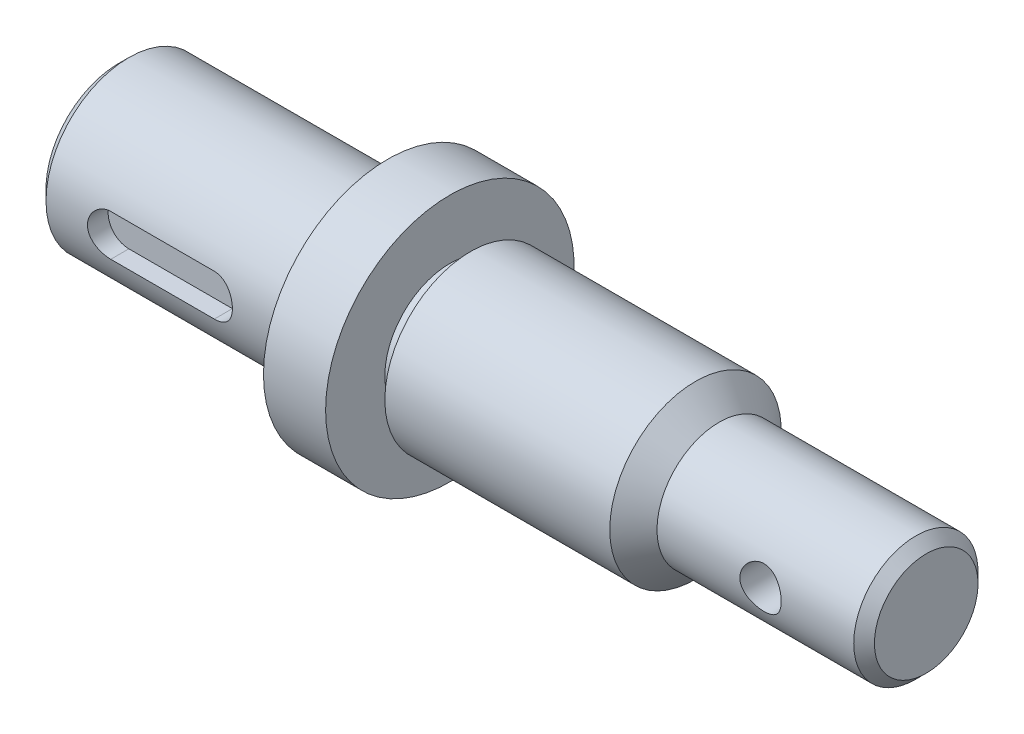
from build123d import *

# Parameters (mm, degrees)
CHAMFER_1_SIZE      = 0.5
CHAMFER_2_SIZE      = 0.5
CUT_EXTRUDE_1_DEPTH = 1
SKETCH_4_R          = 1
CUT_EXTRUDE_2_DEPTH = 41.706264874


with BuildPart() as part:
    # Sketch 2 → Revolve 1 (revolve)
    with BuildSketch(Plane.XY, mode=Mode.PRIVATE) as revolve_1_sk:
        Polygon((0, 0), (0, 4), (12, 4), (12, 3), (13, 3), (13, 6), (16, 6), (16, 3.140032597), (17, 3.140032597), (17, 4.140032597), (27.859967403, 4.140032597), (29, 3), (39, 3), (39, 0), align=None)
    revolve(revolve_1_sk.sketch.rotate(Axis((-89.92183908, 0, 0), (1, 0, 0)), 90), axis=Axis((-89.92183908, 0, 0), (1, 0, 0)))

    # Chamfer 1
    chamfer_1_edges = [part.edges().sort_by_distance(p)[0] for p in [
        (0, 0, -4),
    ]]
    chamfer(chamfer_1_edges, length=CHAMFER_1_SIZE)

    # Chamfer 2
    chamfer_2_edges = [part.edges().sort_by_distance(p)[0] for p in [
        (39, 0, -3),
    ]]
    chamfer(chamfer_2_edges, length=CHAMFER_2_SIZE)

    # Sketch 3 → Cut-Extrude 1 (cut)
    with BuildSketch(Plane.XY.offset(4)):
        with BuildLine():
            Line((3.5, 1), (8.5, 1))
            ThreePointArc((8.5, 1), (9.5, 0), (8.5, -1))
            Line((8.5, -1), (3.5, -1))
            ThreePointArc((3.5, -1), (2.5, 0), (3.5, 1))
        make_face()
    extrude(amount=-CUT_EXTRUDE_1_DEPTH, mode=Mode.SUBTRACT)

    # Sketch 4 → Cut-Extrude 2 (cut, through all)
    with BuildSketch(Plane.XY.offset(4)):
        with Locations((34, 0)):
            Circle(SKETCH_4_R)
    extrude(amount=-CUT_EXTRUDE_2_DEPTH, mode=Mode.SUBTRACT)


solid = part.part
